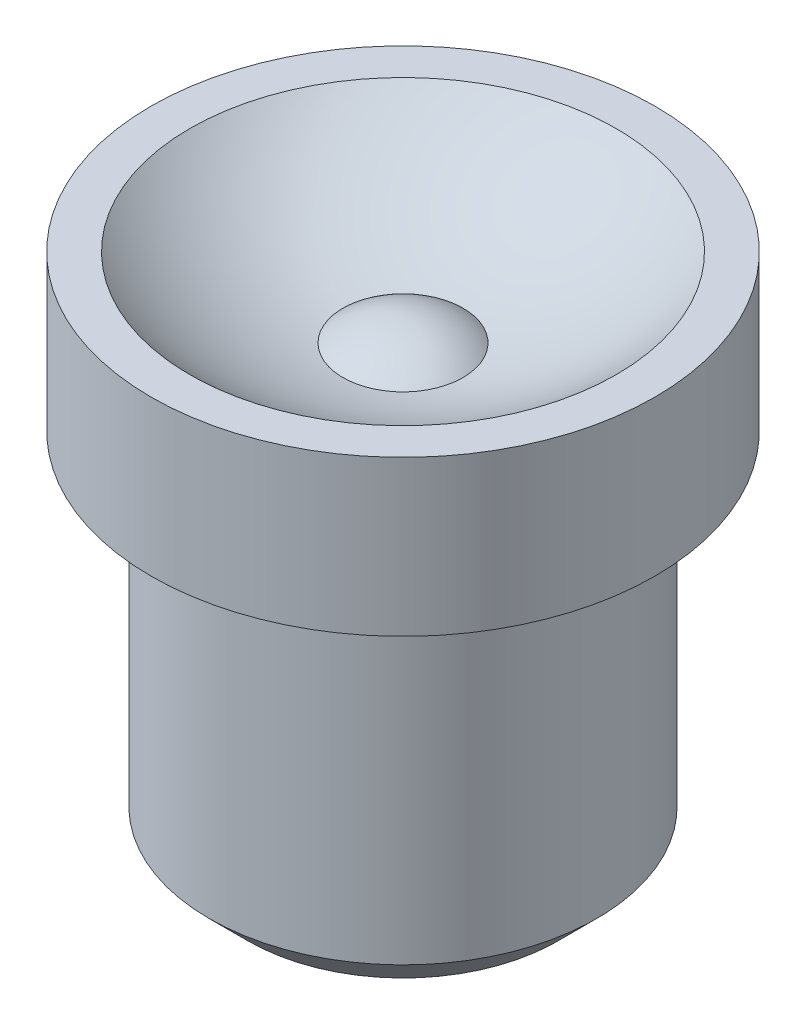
from build123d import *

# Parameters (mm, degrees)
CHANFREIN1_SIZE = 0.5


with BuildPart() as part:
    # Esquisse1 → R_volution1 (revolve)
    with BuildSketch(Plane.XY):
        with BuildLine():
            Line((2.75, 0), (3.25, 0))
            Line((3.25, 0), (3.25, -2))
            Line((3.25, -2), (2.5, -2))
            Line((2.5, -2), (2.5, -6.7))
            Line((2.5, -6.7), (0.8, -6.7))
            Line((0.8, -6.7), (0.8, -2.960468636))
            ThreePointArc((0.8, -2.960468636), (0.42539053, -3.17539053), (0, -3.25))
            Line((0, -3.25), (0, -0.75))
            ThreePointArc((0, -0.75), (0.410352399, -0.819275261), (0.775221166, -1.019422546))
            ThreePointArc((0.775221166, -1.019422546), (1.834830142, -0.649611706), (2.75, 0))
        make_face()
    revolve(axis=Axis((0, 0, 0), (0, -1, 0)))

    # Chanfrein1
    chanfrein1_edges = [part.edges().sort_by_distance(p)[0] for p in [
        (-2.5, -6.7, 0),
    ]]
    chamfer(chanfrein1_edges, length=CHANFREIN1_SIZE)


solid = part.part
